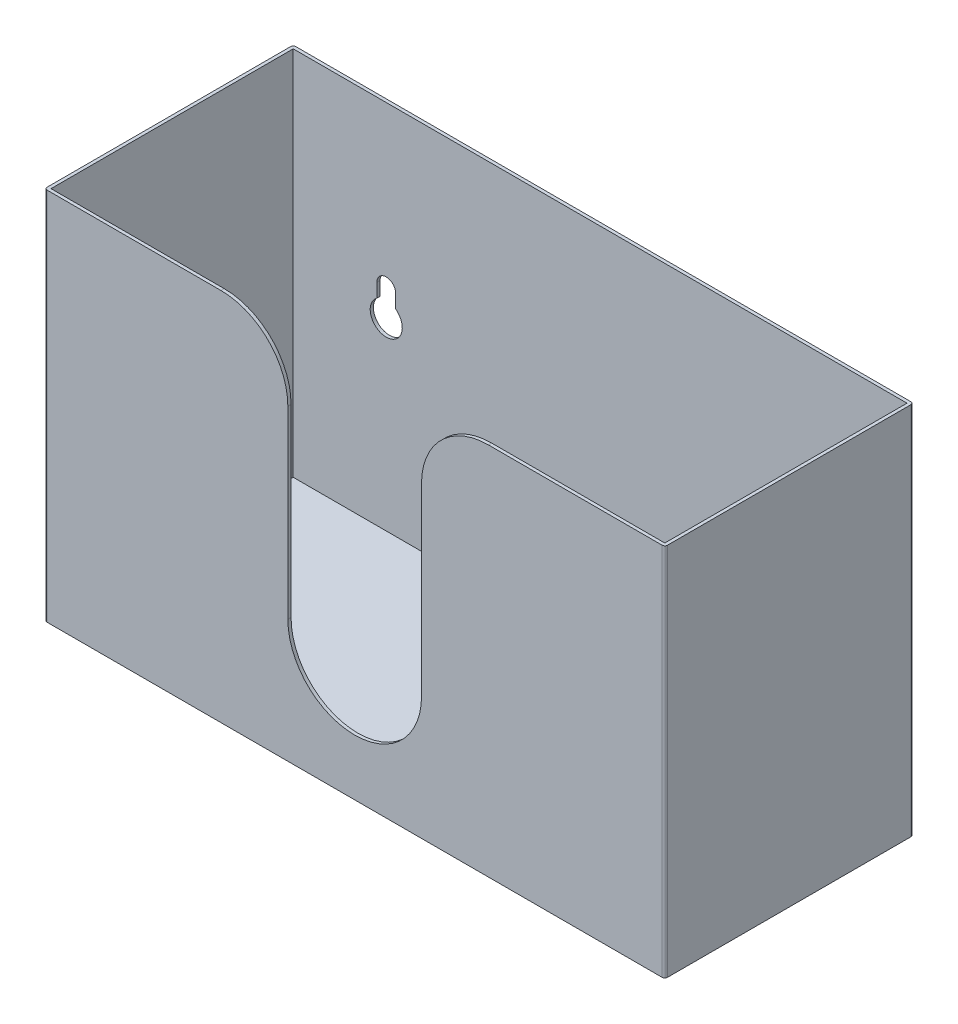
ISO-10303-21;
HEADER;
FILE_DESCRIPTION(('STEP AP214'),'2;1');
FILE_NAME('part.step','',(''),(''),'','','');
FILE_SCHEMA(('AUTOMOTIVE_DESIGN { 1 0 10303 214 1 1 1 1 }'));
ENDSEC;
DATA;
#1=APPLICATION_CONTEXT('core data for automotive mechanical design processes');
#2=APPLICATION_PROTOCOL_DEFINITION('international standard','automotive_design',2000,#1);
#3=PRODUCT_CONTEXT('',#1,'mechanical');
#4=PRODUCT('Part','Part','',(#3));
#5=PRODUCT_RELATED_PRODUCT_CATEGORY('part','',(#4));
#6=PRODUCT_DEFINITION_FORMATION('','',#4);
#7=PRODUCT_DEFINITION_CONTEXT('part definition',#1,'design');
#8=PRODUCT_DEFINITION('design','',#6,#7);
#9=PRODUCT_DEFINITION_SHAPE('','',#8);
#10=(LENGTH_UNIT() NAMED_UNIT(*) SI_UNIT(.MILLI.,.METRE.));
#11=(NAMED_UNIT(*) PLANE_ANGLE_UNIT() SI_UNIT($,.RADIAN.));
#12=(NAMED_UNIT(*) SI_UNIT($,.STERADIAN.) SOLID_ANGLE_UNIT());
#13=UNCERTAINTY_MEASURE_WITH_UNIT(LENGTH_MEASURE(1.E-05),#10,'distance_accuracy_value','');
#14=(GEOMETRIC_REPRESENTATION_CONTEXT(3) GLOBAL_UNCERTAINTY_ASSIGNED_CONTEXT((#13)) GLOBAL_UNIT_ASSIGNED_CONTEXT((#10,
#11,#12)) REPRESENTATION_CONTEXT('',''));
#15=CARTESIAN_POINT('',(0.,0.,0.));
#16=DIRECTION('',(0.,0.,1.));
#17=DIRECTION('',(1.,0.,0.));
#18=AXIS2_PLACEMENT_3D('',#15,#16,#17);
#19=CARTESIAN_POINT('',(116.,140.,-46.5));
#20=DIRECTION('',(0.,0.,1.));
#21=DIRECTION('',(1.,0.,0.));
#22=AXIS2_PLACEMENT_3D('',#19,#20,#21);
#23=PLANE('',#22);
#24=DIRECTION('',(0.,1.,0.));
#25=VECTOR('',#24,1.);
#26=CARTESIAN_POINT('',(76.5000000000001,1.06165076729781E-13,-46.5));
#27=LINE('',#26,#25);
#28=CARTESIAN_POINT('',(76.5,74.8733971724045,-46.5));
#29=VERTEX_POINT('',#28);
#30=CARTESIAN_POINT('',(76.5,80.,-46.5));
#31=VERTEX_POINT('',#30);
#32=EDGE_CURVE('E222',#29,#31,#27,.T.);
#33=ORIENTED_EDGE('',*,*,#32,.F.);
#34=CARTESIAN_POINT('',(80.,70.,-46.5));
#35=DIRECTION('',(0.,0.,-1.));
#36=DIRECTION('',(-1.,0.,0.));
#37=AXIS2_PLACEMENT_3D('',#34,#35,#36);
#38=CIRCLE('',#37,6.00000000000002);
#39=CARTESIAN_POINT('',(83.5,74.8733971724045,-46.5));
#40=VERTEX_POINT('',#39);
#41=EDGE_CURVE('E48',#40,#29,#38,.T.);
#42=ORIENTED_EDGE('',*,*,#41,.F.);
#43=DIRECTION('',(0.,1.,0.));
#44=VECTOR('',#43,1.);
#45=CARTESIAN_POINT('',(83.4999999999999,-1.15879528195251E-13,-46.5));
#46=LINE('',#45,#44);
#47=CARTESIAN_POINT('',(83.5,80.,-46.5));
#48=VERTEX_POINT('',#47);
#49=EDGE_CURVE('E228',#40,#48,#46,.T.);
#50=ORIENTED_EDGE('',*,*,#49,.T.);
#51=CARTESIAN_POINT('',(80.,80.,-46.5));
#52=DIRECTION('',(0.,0.,-1.));
#53=DIRECTION('',(-1.,0.,0.));
#54=AXIS2_PLACEMENT_3D('',#51,#52,#53);
#55=CIRCLE('',#54,3.50000000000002);
#56=EDGE_CURVE('E212',#31,#48,#55,.T.);
#57=ORIENTED_EDGE('',*,*,#56,.F.);
#58=EDGE_LOOP('',(#33,#42,#50,#57));
#59=FACE_BOUND('',#58,.T.);
#60=DIRECTION('',(-1.,0.,0.));
#61=VECTOR('',#60,1.);
#62=CARTESIAN_POINT('',(116.,0.,-46.5));
#63=LINE('',#62,#61);
#64=CARTESIAN_POINT('',(115.,0.,-46.5));
#65=VERTEX_POINT('',#64);
#66=CARTESIAN_POINT('',(-115.,0.,-46.5));
#67=VERTEX_POINT('',#66);
#68=EDGE_CURVE('E303',#65,#67,#63,.T.);
#69=ORIENTED_EDGE('',*,*,#68,.T.);
#70=DIRECTION('',(0.,-1.,0.));
#71=VECTOR('',#70,1.);
#72=CARTESIAN_POINT('',(-115.,140.,-46.5));
#73=LINE('',#72,#71);
#74=CARTESIAN_POINT('',(-115.,140.,-46.5));
#75=VERTEX_POINT('',#74);
#76=EDGE_CURVE('E339',#67,#75,#73,.F.);
#77=ORIENTED_EDGE('',*,*,#76,.T.);
#78=DIRECTION('',(-1.,0.,0.));
#79=VECTOR('',#78,1.);
#80=CARTESIAN_POINT('',(116.,140.,-46.5));
#81=LINE('',#80,#79);
#82=CARTESIAN_POINT('',(115.,140.,-46.5));
#83=VERTEX_POINT('',#82);
#84=EDGE_CURVE('E310',#83,#75,#81,.T.);
#85=ORIENTED_EDGE('',*,*,#84,.F.);
#86=DIRECTION('',(0.,-1.,0.));
#87=VECTOR('',#86,1.);
#88=CARTESIAN_POINT('',(115.,140.,-46.5));
#89=LINE('',#88,#87);
#90=EDGE_CURVE('E336',#83,#65,#89,.T.);
#91=ORIENTED_EDGE('',*,*,#90,.T.);
#92=EDGE_LOOP('',(#69,#77,#85,#91));
#93=FACE_BOUND('',#92,.T.);
#94=CARTESIAN_POINT('',(-80.,70.,-46.5));
#95=DIRECTION('',(0.,0.,-1.));
#96=DIRECTION('',(-1.,0.,0.));
#97=AXIS2_PLACEMENT_3D('',#94,#95,#96);
#98=CIRCLE('',#97,6.00000000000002);
#99=CARTESIAN_POINT('',(-83.5,74.8733971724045,-46.5));
#100=VERTEX_POINT('',#99);
#101=CARTESIAN_POINT('',(-76.5,74.8733971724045,-46.5));
#102=VERTEX_POINT('',#101);
#103=EDGE_CURVE('E56',#100,#102,#98,.F.);
#104=ORIENTED_EDGE('',*,*,#103,.T.);
#105=DIRECTION('',(0.,1.,0.));
#106=VECTOR('',#105,1.);
#107=CARTESIAN_POINT('',(-76.5000000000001,1.06165076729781E-13,-46.5));
#108=LINE('',#107,#106);
#109=CARTESIAN_POINT('',(-76.5,80.,-46.5));
#110=VERTEX_POINT('',#109);
#111=EDGE_CURVE('E245',#102,#110,#108,.T.);
#112=ORIENTED_EDGE('',*,*,#111,.T.);
#113=CARTESIAN_POINT('',(-80.,80.,-46.5));
#114=DIRECTION('',(0.,0.,-1.));
#115=DIRECTION('',(-1.,0.,0.));
#116=AXIS2_PLACEMENT_3D('',#113,#114,#115);
#117=CIRCLE('',#116,3.50000000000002);
#118=CARTESIAN_POINT('',(-83.5,80.,-46.5));
#119=VERTEX_POINT('',#118);
#120=EDGE_CURVE('E242',#110,#119,#117,.F.);
#121=ORIENTED_EDGE('',*,*,#120,.T.);
#122=DIRECTION('',(0.,1.,0.));
#123=VECTOR('',#122,1.);
#124=CARTESIAN_POINT('',(-83.4999999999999,-1.15879528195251E-13,-46.5));
#125=LINE('',#124,#123);
#126=EDGE_CURVE('E239',#100,#119,#125,.T.);
#127=ORIENTED_EDGE('',*,*,#126,.F.);
#128=EDGE_LOOP('',(#104,#112,#121,#127));
#129=FACE_BOUND('',#128,.T.);
#130=ADVANCED_FACE('F33',(#59,#93,#129),#23,.F.);
#131=CARTESIAN_POINT('',(116.,140.,-45.3));
#132=DIRECTION('',(0.,0.,1.));
#133=DIRECTION('',(1.,0.,0.));
#134=AXIS2_PLACEMENT_3D('',#131,#132,#133);
#135=PLANE('',#134);
#136=CARTESIAN_POINT('',(80.,70.,-45.3));
#137=DIRECTION('',(0.,0.,1.));
#138=DIRECTION('',(1.,0.,0.));
#139=AXIS2_PLACEMENT_3D('',#136,#137,#138);
#140=CIRCLE('',#139,6.00000000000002);
#141=CARTESIAN_POINT('',(76.5,74.8733971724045,-45.3));
#142=VERTEX_POINT('',#141);
#143=CARTESIAN_POINT('',(83.5,74.8733971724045,-45.3));
#144=VERTEX_POINT('',#143);
#145=EDGE_CURVE('E11',#142,#144,#140,.T.);
#146=ORIENTED_EDGE('',*,*,#145,.F.);
#147=DIRECTION('',(0.,-1.,0.));
#148=VECTOR('',#147,1.);
#149=CARTESIAN_POINT('',(76.4999999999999,140.,-45.3));
#150=LINE('',#149,#148);
#151=CARTESIAN_POINT('',(76.5,80.,-45.3));
#152=VERTEX_POINT('',#151);
#153=EDGE_CURVE('E397',#152,#142,#150,.T.);
#154=ORIENTED_EDGE('',*,*,#153,.F.);
#155=CARTESIAN_POINT('',(80.,80.,-45.3));
#156=DIRECTION('',(0.,0.,1.));
#157=DIRECTION('',(1.,0.,0.));
#158=AXIS2_PLACEMENT_3D('',#155,#156,#157);
#159=CIRCLE('',#158,3.50000000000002);
#160=CARTESIAN_POINT('',(83.5,80.,-45.3));
#161=VERTEX_POINT('',#160);
#162=EDGE_CURVE('E215',#161,#152,#159,.T.);
#163=ORIENTED_EDGE('',*,*,#162,.F.);
#164=DIRECTION('',(0.,-1.,0.));
#165=VECTOR('',#164,1.);
#166=CARTESIAN_POINT('',(83.5000000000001,140.,-45.3));
#167=LINE('',#166,#165);
#168=EDGE_CURVE('E41',#161,#144,#167,.T.);
#169=ORIENTED_EDGE('',*,*,#168,.T.);
#170=EDGE_LOOP('',(#146,#154,#163,#169));
#171=FACE_BOUND('',#170,.T.);
#172=DIRECTION('',(-1.,0.,0.));
#173=VECTOR('',#172,1.);
#174=CARTESIAN_POINT('',(116.,1.20000000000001,-45.3));
#175=LINE('',#174,#173);
#176=CARTESIAN_POINT('',(114.8,1.2,-45.3));
#177=VERTEX_POINT('',#176);
#178=CARTESIAN_POINT('',(-114.8,1.2,-45.3));
#179=VERTEX_POINT('',#178);
#180=EDGE_CURVE('E284',#177,#179,#175,.T.);
#181=ORIENTED_EDGE('',*,*,#180,.F.);
#182=DIRECTION('',(0.,1.,0.));
#183=VECTOR('',#182,1.);
#184=CARTESIAN_POINT('',(114.8,140.,-45.3));
#185=LINE('',#184,#183);
#186=CARTESIAN_POINT('',(114.8,140.,-45.3));
#187=VERTEX_POINT('',#186);
#188=EDGE_CURVE('E271',#177,#187,#185,.T.);
#189=ORIENTED_EDGE('',*,*,#188,.T.);
#190=DIRECTION('',(-1.,0.,0.));
#191=VECTOR('',#190,1.);
#192=CARTESIAN_POINT('',(116.,140.,-45.3));
#193=LINE('',#192,#191);
#194=CARTESIAN_POINT('',(-114.8,140.,-45.3));
#195=VERTEX_POINT('',#194);
#196=EDGE_CURVE('E276',#187,#195,#193,.T.);
#197=ORIENTED_EDGE('',*,*,#196,.T.);
#198=DIRECTION('',(0.,1.,0.));
#199=VECTOR('',#198,1.);
#200=CARTESIAN_POINT('',(-114.8,140.,-45.3));
#201=LINE('',#200,#199);
#202=EDGE_CURVE('E269',#179,#195,#201,.T.);
#203=ORIENTED_EDGE('',*,*,#202,.F.);
#204=EDGE_LOOP('',(#181,#189,#197,#203));
#205=FACE_BOUND('',#204,.T.);
#206=DIRECTION('',(0.,-1.,0.));
#207=VECTOR('',#206,1.);
#208=CARTESIAN_POINT('',(-76.4999999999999,140.,-45.3));
#209=LINE('',#208,#207);
#210=CARTESIAN_POINT('',(-76.5,80.,-45.3));
#211=VERTEX_POINT('',#210);
#212=CARTESIAN_POINT('',(-76.5,74.8733971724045,-45.3));
#213=VERTEX_POINT('',#212);
#214=EDGE_CURVE('E391',#211,#213,#209,.T.);
#215=ORIENTED_EDGE('',*,*,#214,.T.);
#216=CARTESIAN_POINT('',(-80.,70.,-45.3));
#217=DIRECTION('',(0.,0.,1.));
#218=DIRECTION('',(1.,0.,0.));
#219=AXIS2_PLACEMENT_3D('',#216,#217,#218);
#220=CIRCLE('',#219,6.00000000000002);
#221=CARTESIAN_POINT('',(-83.5,74.8733971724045,-45.3));
#222=VERTEX_POINT('',#221);
#223=EDGE_CURVE('E394',#213,#222,#220,.F.);
#224=ORIENTED_EDGE('',*,*,#223,.T.);
#225=DIRECTION('',(0.,-1.,0.));
#226=VECTOR('',#225,1.);
#227=CARTESIAN_POINT('',(-83.5000000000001,140.,-45.3));
#228=LINE('',#227,#226);
#229=CARTESIAN_POINT('',(-83.5,80.,-45.3));
#230=VERTEX_POINT('',#229);
#231=EDGE_CURVE('E386',#230,#222,#228,.T.);
#232=ORIENTED_EDGE('',*,*,#231,.F.);
#233=CARTESIAN_POINT('',(-80.,80.,-45.3));
#234=DIRECTION('',(0.,0.,1.));
#235=DIRECTION('',(1.,0.,0.));
#236=AXIS2_PLACEMENT_3D('',#233,#234,#235);
#237=CIRCLE('',#236,3.50000000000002);
#238=EDGE_CURVE('E388',#230,#211,#237,.F.);
#239=ORIENTED_EDGE('',*,*,#238,.T.);
#240=EDGE_LOOP('',(#215,#224,#232,#239));
#241=FACE_BOUND('',#240,.T.);
#242=ADVANCED_FACE('F402',(#171,#205,#241),#135,.T.);
#243=CARTESIAN_POINT('',(-116.,140.,46.5));
#244=DIRECTION('',(1.,0.,0.));
#245=DIRECTION('',(0.,0.,-1.));
#246=AXIS2_PLACEMENT_3D('',#243,#244,#245);
#247=PLANE('',#246);
#248=DIRECTION('',(0.,0.,1.));
#249=VECTOR('',#248,1.);
#250=CARTESIAN_POINT('',(-116.,140.,46.5));
#251=LINE('',#250,#249);
#252=CARTESIAN_POINT('',(-116.,140.,-45.5));
#253=VERTEX_POINT('',#252);
#254=CARTESIAN_POINT('',(-116.,140.,45.5));
#255=VERTEX_POINT('',#254);
#256=EDGE_CURVE('E299',#253,#255,#251,.T.);
#257=ORIENTED_EDGE('',*,*,#256,.F.);
#258=DIRECTION('',(0.,-1.,0.));
#259=VECTOR('',#258,1.);
#260=CARTESIAN_POINT('',(-116.,140.,-45.5));
#261=LINE('',#260,#259);
#262=CARTESIAN_POINT('',(-116.,0.,-45.5));
#263=VERTEX_POINT('',#262);
#264=EDGE_CURVE('E325',#253,#263,#261,.T.);
#265=ORIENTED_EDGE('',*,*,#264,.T.);
#266=DIRECTION('',(0.,0.,1.));
#267=VECTOR('',#266,1.);
#268=CARTESIAN_POINT('',(-116.,0.,46.5));
#269=LINE('',#268,#267);
#270=CARTESIAN_POINT('',(-116.,0.,45.5));
#271=VERTEX_POINT('',#270);
#272=EDGE_CURVE('E282',#263,#271,#269,.T.);
#273=ORIENTED_EDGE('',*,*,#272,.T.);
#274=DIRECTION('',(0.,-1.,0.));
#275=VECTOR('',#274,1.);
#276=CARTESIAN_POINT('',(-116.,140.,45.5));
#277=LINE('',#276,#275);
#278=EDGE_CURVE('E313',#271,#255,#277,.F.);
#279=ORIENTED_EDGE('',*,*,#278,.T.);
#280=EDGE_LOOP('',(#257,#265,#273,#279));
#281=FACE_BOUND('',#280,.T.);
#282=ADVANCED_FACE('F426',(#281),#247,.F.);
#283=CARTESIAN_POINT('',(116.,140.,46.5));
#284=DIRECTION('',(0.,0.,-1.));
#285=DIRECTION('',(-1.,0.,0.));
#286=AXIS2_PLACEMENT_3D('',#283,#284,#285);
#287=PLANE('',#286);
#288=DIRECTION('',(1.,0.,0.));
#289=VECTOR('',#288,1.);
#290=CARTESIAN_POINT('',(116.,140.,46.5));
#291=LINE('',#290,#289);
#292=CARTESIAN_POINT('',(50.0000000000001,140.,46.5));
#293=VERTEX_POINT('',#292);
#294=CARTESIAN_POINT('',(115.,140.,46.5));
#295=VERTEX_POINT('',#294);
#296=EDGE_CURVE('E302',#293,#295,#291,.T.);
#297=ORIENTED_EDGE('',*,*,#296,.F.);
#298=CARTESIAN_POINT('',(50.,115.,46.5));
#299=DIRECTION('',(0.,0.,-1.));
#300=DIRECTION('',(-1.,0.,0.));
#301=AXIS2_PLACEMENT_3D('',#298,#299,#300);
#302=CIRCLE('',#301,25.);
#303=CARTESIAN_POINT('',(25.,115.,46.5));
#304=VERTEX_POINT('',#303);
#305=EDGE_CURVE('E381',#293,#304,#302,.F.);
#306=ORIENTED_EDGE('',*,*,#305,.T.);
#307=DIRECTION('',(0.,1.,0.));
#308=VECTOR('',#307,1.);
#309=CARTESIAN_POINT('',(25.,234.,46.5));
#310=LINE('',#309,#308);
#311=CARTESIAN_POINT('',(25.,46.,46.5));
#312=VERTEX_POINT('',#311);
#313=EDGE_CURVE('E260',#312,#304,#310,.T.);
#314=ORIENTED_EDGE('',*,*,#313,.F.);
#315=CARTESIAN_POINT('',(0.,46.,46.5));
#316=DIRECTION('',(0.,0.,1.));
#317=DIRECTION('',(1.,0.,0.));
#318=AXIS2_PLACEMENT_3D('',#315,#316,#317);
#319=CIRCLE('',#318,25.);
#320=CARTESIAN_POINT('',(-25.,46.,46.5));
#321=VERTEX_POINT('',#320);
#322=EDGE_CURVE('E257',#321,#312,#319,.T.);
#323=ORIENTED_EDGE('',*,*,#322,.F.);
#324=DIRECTION('',(0.,-1.,0.));
#325=VECTOR('',#324,1.);
#326=CARTESIAN_POINT('',(-25.,234.,46.5));
#327=LINE('',#326,#325);
#328=CARTESIAN_POINT('',(-25.,115.,46.5));
#329=VERTEX_POINT('',#328);
#330=EDGE_CURVE('E235',#329,#321,#327,.T.);
#331=ORIENTED_EDGE('',*,*,#330,.F.);
#332=CARTESIAN_POINT('',(-50.,115.,46.5));
#333=DIRECTION('',(0.,0.,-1.));
#334=DIRECTION('',(-1.,0.,0.));
#335=AXIS2_PLACEMENT_3D('',#332,#333,#334);
#336=CIRCLE('',#335,25.);
#337=CARTESIAN_POINT('',(-49.9999999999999,140.,46.5));
#338=VERTEX_POINT('',#337);
#339=EDGE_CURVE('E379',#329,#338,#336,.F.);
#340=ORIENTED_EDGE('',*,*,#339,.T.);
#341=CARTESIAN_POINT('',(-115.,140.,46.5));
#342=VERTEX_POINT('',#341);
#343=EDGE_CURVE('E304',#342,#338,#291,.T.);
#344=ORIENTED_EDGE('',*,*,#343,.F.);
#345=DIRECTION('',(0.,-1.,0.));
#346=VECTOR('',#345,1.);
#347=CARTESIAN_POINT('',(-115.,140.,46.5));
#348=LINE('',#347,#346);
#349=CARTESIAN_POINT('',(-115.,0.,46.5));
#350=VERTEX_POINT('',#349);
#351=EDGE_CURVE('E354',#342,#350,#348,.T.);
#352=ORIENTED_EDGE('',*,*,#351,.T.);
#353=DIRECTION('',(1.,0.,0.));
#354=VECTOR('',#353,1.);
#355=CARTESIAN_POINT('',(116.,0.,46.5));
#356=LINE('',#355,#354);
#357=CARTESIAN_POINT('',(115.,0.,46.5));
#358=VERTEX_POINT('',#357);
#359=EDGE_CURVE('E316',#350,#358,#356,.T.);
#360=ORIENTED_EDGE('',*,*,#359,.T.);
#361=DIRECTION('',(0.,-1.,0.));
#362=VECTOR('',#361,1.);
#363=CARTESIAN_POINT('',(115.,140.,46.5));
#364=LINE('',#363,#362);
#365=EDGE_CURVE('E357',#358,#295,#364,.F.);
#366=ORIENTED_EDGE('',*,*,#365,.T.);
#367=EDGE_LOOP('',(#297,#306,#314,#323,#331,#340,#344,#352,#360,#366));
#368=FACE_BOUND('',#367,.T.);
#369=ADVANCED_FACE('F436',(#368),#287,.F.);
#370=CARTESIAN_POINT('',(116.,140.,46.5));
#371=DIRECTION('',(-1.,0.,0.));
#372=DIRECTION('',(0.,0.,1.));
#373=AXIS2_PLACEMENT_3D('',#370,#371,#372);
#374=PLANE('',#373);
#375=DIRECTION('',(0.,0.,-1.));
#376=VECTOR('',#375,1.);
#377=CARTESIAN_POINT('',(116.,0.,46.5));
#378=LINE('',#377,#376);
#379=CARTESIAN_POINT('',(116.,0.,45.5));
#380=VERTEX_POINT('',#379);
#381=CARTESIAN_POINT('',(116.,0.,-45.5));
#382=VERTEX_POINT('',#381);
#383=EDGE_CURVE('E319',#380,#382,#378,.T.);
#384=ORIENTED_EDGE('',*,*,#383,.T.);
#385=DIRECTION('',(0.,-1.,0.));
#386=VECTOR('',#385,1.);
#387=CARTESIAN_POINT('',(116.,140.,-45.5));
#388=LINE('',#387,#386);
#389=CARTESIAN_POINT('',(116.,140.,-45.5));
#390=VERTEX_POINT('',#389);
#391=EDGE_CURVE('E352',#382,#390,#388,.F.);
#392=ORIENTED_EDGE('',*,*,#391,.T.);
#393=DIRECTION('',(0.,0.,-1.));
#394=VECTOR('',#393,1.);
#395=CARTESIAN_POINT('',(116.,140.,46.5));
#396=LINE('',#395,#394);
#397=CARTESIAN_POINT('',(116.,140.,45.5));
#398=VERTEX_POINT('',#397);
#399=EDGE_CURVE('E307',#398,#390,#396,.T.);
#400=ORIENTED_EDGE('',*,*,#399,.F.);
#401=DIRECTION('',(0.,-1.,0.));
#402=VECTOR('',#401,1.);
#403=CARTESIAN_POINT('',(116.,140.,45.5));
#404=LINE('',#403,#402);
#405=EDGE_CURVE('E349',#398,#380,#404,.T.);
#406=ORIENTED_EDGE('',*,*,#405,.T.);
#407=EDGE_LOOP('',(#384,#392,#400,#406));
#408=FACE_BOUND('',#407,.T.);
#409=ADVANCED_FACE('F432',(#408),#374,.F.);
#410=CARTESIAN_POINT('',(0.,140.,0.));
#411=DIRECTION('',(0.,1.,0.));
#412=DIRECTION('',(0.,0.,1.));
#413=AXIS2_PLACEMENT_3D('',#410,#411,#412);
#414=PLANE('',#413);
#415=DIRECTION('',(1.,0.,0.));
#416=VECTOR('',#415,1.);
#417=CARTESIAN_POINT('',(116.,140.,45.3));
#418=LINE('',#417,#416);
#419=CARTESIAN_POINT('',(50.,140.,45.3));
#420=VERTEX_POINT('',#419);
#421=CARTESIAN_POINT('',(114.8,140.,45.3));
#422=VERTEX_POINT('',#421);
#423=EDGE_CURVE('E290',#420,#422,#418,.T.);
#424=ORIENTED_EDGE('',*,*,#423,.F.);
#425=DIRECTION('',(0.,0.,-1.));
#426=VECTOR('',#425,1.);
#427=CARTESIAN_POINT('',(50.,140.,46.5));
#428=LINE('',#427,#426);
#429=EDGE_CURVE('E377',#420,#293,#428,.F.);
#430=ORIENTED_EDGE('',*,*,#429,.T.);
#431=ORIENTED_EDGE('',*,*,#296,.T.);
#432=CARTESIAN_POINT('',(115.,140.,45.5));
#433=DIRECTION('',(0.,1.,0.));
#434=DIRECTION('',(0.,0.,1.));
#435=AXIS2_PLACEMENT_3D('',#432,#433,#434);
#436=CIRCLE('',#435,1.);
#437=EDGE_CURVE('E343',#295,#398,#436,.T.);
#438=ORIENTED_EDGE('',*,*,#437,.T.);
#439=ORIENTED_EDGE('',*,*,#399,.T.);
#440=CARTESIAN_POINT('',(115.,140.,-45.5));
#441=DIRECTION('',(0.,1.,0.));
#442=DIRECTION('',(0.,0.,1.));
#443=AXIS2_PLACEMENT_3D('',#440,#441,#442);
#444=CIRCLE('',#443,1.);
#445=EDGE_CURVE('E345',#390,#83,#444,.T.);
#446=ORIENTED_EDGE('',*,*,#445,.T.);
#447=ORIENTED_EDGE('',*,*,#84,.T.);
#448=CARTESIAN_POINT('',(-115.,140.,-45.5));
#449=DIRECTION('',(0.,1.,0.));
#450=DIRECTION('',(0.,0.,1.));
#451=AXIS2_PLACEMENT_3D('',#448,#449,#450);
#452=CIRCLE('',#451,1.);
#453=EDGE_CURVE('E347',#75,#253,#452,.T.);
#454=ORIENTED_EDGE('',*,*,#453,.T.);
#455=ORIENTED_EDGE('',*,*,#256,.T.);
#456=CARTESIAN_POINT('',(-115.,140.,45.5));
#457=DIRECTION('',(0.,1.,0.));
#458=DIRECTION('',(0.,0.,1.));
#459=AXIS2_PLACEMENT_3D('',#456,#457,#458);
#460=CIRCLE('',#459,1.);
#461=EDGE_CURVE('E341',#255,#342,#460,.T.);
#462=ORIENTED_EDGE('',*,*,#461,.T.);
#463=ORIENTED_EDGE('',*,*,#343,.T.);
#464=DIRECTION('',(0.,0.,1.));
#465=VECTOR('',#464,1.);
#466=CARTESIAN_POINT('',(-50.,140.,45.3));
#467=LINE('',#466,#465);
#468=CARTESIAN_POINT('',(-50.,140.,45.3));
#469=VERTEX_POINT('',#468);
#470=EDGE_CURVE('E375',#338,#469,#467,.F.);
#471=ORIENTED_EDGE('',*,*,#470,.T.);
#472=CARTESIAN_POINT('',(-114.8,140.,45.3));
#473=VERTEX_POINT('',#472);
#474=EDGE_CURVE('E291',#473,#469,#418,.T.);
#475=ORIENTED_EDGE('',*,*,#474,.F.);
#476=DIRECTION('',(0.,0.,1.));
#477=VECTOR('',#476,1.);
#478=CARTESIAN_POINT('',(-114.8,140.,46.5));
#479=LINE('',#478,#477);
#480=EDGE_CURVE('E287',#195,#473,#479,.T.);
#481=ORIENTED_EDGE('',*,*,#480,.F.);
#482=ORIENTED_EDGE('',*,*,#196,.F.);
#483=DIRECTION('',(0.,0.,-1.));
#484=VECTOR('',#483,1.);
#485=CARTESIAN_POINT('',(114.8,140.,46.5));
#486=LINE('',#485,#484);
#487=EDGE_CURVE('E294',#422,#187,#486,.T.);
#488=ORIENTED_EDGE('',*,*,#487,.F.);
#489=EDGE_LOOP('',(#424,#430,#431,#438,#439,#446,#447,#454,#455,#462,#463,#471,#475,#481,#482,#488));
#490=FACE_BOUND('',#489,.T.);
#491=ADVANCED_FACE('F435',(#490),#414,.T.);
#492=CARTESIAN_POINT('',(0.,0.,0.));
#493=DIRECTION('',(0.,1.,0.));
#494=DIRECTION('',(0.,0.,1.));
#495=AXIS2_PLACEMENT_3D('',#492,#493,#494);
#496=PLANE('',#495);
#497=ORIENTED_EDGE('',*,*,#272,.F.);
#498=CARTESIAN_POINT('',(-115.,0.,-45.5));
#499=DIRECTION('',(0.,1.,0.));
#500=DIRECTION('',(0.,0.,1.));
#501=AXIS2_PLACEMENT_3D('',#498,#499,#500);
#502=CIRCLE('',#501,1.);
#503=EDGE_CURVE('E334',#263,#67,#502,.F.);
#504=ORIENTED_EDGE('',*,*,#503,.T.);
#505=ORIENTED_EDGE('',*,*,#68,.F.);
#506=CARTESIAN_POINT('',(115.,0.,-45.5));
#507=DIRECTION('',(0.,1.,0.));
#508=DIRECTION('',(0.,0.,1.));
#509=AXIS2_PLACEMENT_3D('',#506,#507,#508);
#510=CIRCLE('',#509,1.);
#511=EDGE_CURVE('E332',#65,#382,#510,.F.);
#512=ORIENTED_EDGE('',*,*,#511,.T.);
#513=ORIENTED_EDGE('',*,*,#383,.F.);
#514=CARTESIAN_POINT('',(115.,0.,45.5));
#515=DIRECTION('',(0.,1.,0.));
#516=DIRECTION('',(0.,0.,1.));
#517=AXIS2_PLACEMENT_3D('',#514,#515,#516);
#518=CIRCLE('',#517,1.);
#519=EDGE_CURVE('E330',#380,#358,#518,.F.);
#520=ORIENTED_EDGE('',*,*,#519,.T.);
#521=ORIENTED_EDGE('',*,*,#359,.F.);
#522=CARTESIAN_POINT('',(-115.,0.,45.5));
#523=DIRECTION('',(0.,1.,0.));
#524=DIRECTION('',(0.,0.,1.));
#525=AXIS2_PLACEMENT_3D('',#522,#523,#524);
#526=CIRCLE('',#525,1.);
#527=EDGE_CURVE('E328',#350,#271,#526,.F.);
#528=ORIENTED_EDGE('',*,*,#527,.T.);
#529=EDGE_LOOP('',(#497,#504,#505,#512,#513,#520,#521,#528));
#530=FACE_BOUND('',#529,.T.);
#531=ADVANCED_FACE('F430',(#530),#496,.F.);
#532=CARTESIAN_POINT('',(-115.,140.,-45.5));
#533=DIRECTION('',(0.,-1.,0.));
#534=DIRECTION('',(0.,0.,-1.));
#535=AXIS2_PLACEMENT_3D('',#532,#533,#534);
#536=CYLINDRICAL_SURFACE('',#535,1.);
#537=ORIENTED_EDGE('',*,*,#453,.F.);
#538=ORIENTED_EDGE('',*,*,#76,.F.);
#539=ORIENTED_EDGE('',*,*,#503,.F.);
#540=ORIENTED_EDGE('',*,*,#264,.F.);
#541=EDGE_LOOP('',(#537,#538,#539,#540));
#542=FACE_BOUND('',#541,.T.);
#543=ADVANCED_FACE('F444',(#542),#536,.T.);
#544=CARTESIAN_POINT('',(115.,140.,-45.5));
#545=DIRECTION('',(0.,-1.,0.));
#546=DIRECTION('',(0.,0.,-1.));
#547=AXIS2_PLACEMENT_3D('',#544,#545,#546);
#548=CYLINDRICAL_SURFACE('',#547,1.);
#549=ORIENTED_EDGE('',*,*,#445,.F.);
#550=ORIENTED_EDGE('',*,*,#391,.F.);
#551=ORIENTED_EDGE('',*,*,#511,.F.);
#552=ORIENTED_EDGE('',*,*,#90,.F.);
#553=EDGE_LOOP('',(#549,#550,#551,#552));
#554=FACE_BOUND('',#553,.T.);
#555=ADVANCED_FACE('F447',(#554),#548,.T.);
#556=CARTESIAN_POINT('',(115.,140.,45.5));
#557=DIRECTION('',(0.,-1.,0.));
#558=DIRECTION('',(0.,0.,-1.));
#559=AXIS2_PLACEMENT_3D('',#556,#557,#558);
#560=CYLINDRICAL_SURFACE('',#559,1.);
#561=ORIENTED_EDGE('',*,*,#437,.F.);
#562=ORIENTED_EDGE('',*,*,#365,.F.);
#563=ORIENTED_EDGE('',*,*,#519,.F.);
#564=ORIENTED_EDGE('',*,*,#405,.F.);
#565=EDGE_LOOP('',(#561,#562,#563,#564));
#566=FACE_BOUND('',#565,.T.);
#567=ADVANCED_FACE('F451',(#566),#560,.T.);
#568=CARTESIAN_POINT('',(-115.,140.,45.5));
#569=DIRECTION('',(0.,-1.,0.));
#570=DIRECTION('',(0.,0.,-1.));
#571=AXIS2_PLACEMENT_3D('',#568,#569,#570);
#572=CYLINDRICAL_SURFACE('',#571,1.);
#573=ORIENTED_EDGE('',*,*,#461,.F.);
#574=ORIENTED_EDGE('',*,*,#278,.F.);
#575=ORIENTED_EDGE('',*,*,#527,.F.);
#576=ORIENTED_EDGE('',*,*,#351,.F.);
#577=EDGE_LOOP('',(#573,#574,#575,#576));
#578=FACE_BOUND('',#577,.T.);
#579=ADVANCED_FACE('F455',(#578),#572,.T.);
#580=CARTESIAN_POINT('',(-114.8,140.,46.5));
#581=DIRECTION('',(1.,0.,0.));
#582=DIRECTION('',(0.,0.,-1.));
#583=AXIS2_PLACEMENT_3D('',#580,#581,#582);
#584=PLANE('',#583);
#585=ORIENTED_EDGE('',*,*,#480,.T.);
#586=DIRECTION('',(0.,1.,0.));
#587=VECTOR('',#586,1.);
#588=CARTESIAN_POINT('',(-114.8,140.,45.3));
#589=LINE('',#588,#587);
#590=CARTESIAN_POINT('',(-114.8,1.2,45.3));
#591=VERTEX_POINT('',#590);
#592=EDGE_CURVE('E272',#591,#473,#589,.T.);
#593=ORIENTED_EDGE('',*,*,#592,.F.);
#594=DIRECTION('',(0.,0.,1.));
#595=VECTOR('',#594,1.);
#596=CARTESIAN_POINT('',(-114.8,1.20000000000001,46.5));
#597=LINE('',#596,#595);
#598=EDGE_CURVE('E266',#179,#591,#597,.T.);
#599=ORIENTED_EDGE('',*,*,#598,.F.);
#600=ORIENTED_EDGE('',*,*,#202,.T.);
#601=EDGE_LOOP('',(#585,#593,#599,#600));
#602=FACE_BOUND('',#601,.T.);
#603=ADVANCED_FACE('F458',(#602),#584,.T.);
#604=CARTESIAN_POINT('',(116.,140.,45.3));
#605=DIRECTION('',(0.,0.,-1.));
#606=DIRECTION('',(-1.,0.,0.));
#607=AXIS2_PLACEMENT_3D('',#604,#605,#606);
#608=PLANE('',#607);
#609=DIRECTION('',(0.,-1.,0.));
#610=VECTOR('',#609,1.);
#611=CARTESIAN_POINT('',(25.,140.,45.3));
#612=LINE('',#611,#610);
#613=CARTESIAN_POINT('',(25.,115.,45.3));
#614=VERTEX_POINT('',#613);
#615=CARTESIAN_POINT('',(25.,46.,45.3));
#616=VERTEX_POINT('',#615);
#617=EDGE_CURVE('E366',#614,#616,#612,.T.);
#618=ORIENTED_EDGE('',*,*,#617,.F.);
#619=CARTESIAN_POINT('',(50.,115.,45.3));
#620=DIRECTION('',(0.,0.,-1.));
#621=DIRECTION('',(-1.,0.,0.));
#622=AXIS2_PLACEMENT_3D('',#619,#620,#621);
#623=CIRCLE('',#622,25.);
#624=EDGE_CURVE('E373',#614,#420,#623,.T.);
#625=ORIENTED_EDGE('',*,*,#624,.T.);
#626=ORIENTED_EDGE('',*,*,#423,.T.);
#627=DIRECTION('',(0.,1.,0.));
#628=VECTOR('',#627,1.);
#629=CARTESIAN_POINT('',(114.8,140.,45.3));
#630=LINE('',#629,#628);
#631=CARTESIAN_POINT('',(114.8,1.2,45.3));
#632=VERTEX_POINT('',#631);
#633=EDGE_CURVE('E279',#632,#422,#630,.T.);
#634=ORIENTED_EDGE('',*,*,#633,.F.);
#635=DIRECTION('',(1.,0.,0.));
#636=VECTOR('',#635,1.);
#637=CARTESIAN_POINT('',(116.,1.20000000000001,45.3));
#638=LINE('',#637,#636);
#639=EDGE_CURVE('E274',#591,#632,#638,.T.);
#640=ORIENTED_EDGE('',*,*,#639,.F.);
#641=ORIENTED_EDGE('',*,*,#592,.T.);
#642=ORIENTED_EDGE('',*,*,#474,.T.);
#643=CARTESIAN_POINT('',(-50.,115.,45.3));
#644=DIRECTION('',(0.,0.,-1.));
#645=DIRECTION('',(-1.,0.,0.));
#646=AXIS2_PLACEMENT_3D('',#643,#644,#645);
#647=CIRCLE('',#646,25.);
#648=CARTESIAN_POINT('',(-25.,115.,45.3));
#649=VERTEX_POINT('',#648);
#650=EDGE_CURVE('E371',#469,#649,#647,.T.);
#651=ORIENTED_EDGE('',*,*,#650,.T.);
#652=DIRECTION('',(0.,1.,0.));
#653=VECTOR('',#652,1.);
#654=CARTESIAN_POINT('',(-25.,140.,45.3));
#655=LINE('',#654,#653);
#656=CARTESIAN_POINT('',(-25.,46.,45.3));
#657=VERTEX_POINT('',#656);
#658=EDGE_CURVE('E360',#657,#649,#655,.T.);
#659=ORIENTED_EDGE('',*,*,#658,.F.);
#660=CARTESIAN_POINT('',(0.,46.,45.3));
#661=DIRECTION('',(0.,0.,-1.));
#662=DIRECTION('',(-1.,0.,0.));
#663=AXIS2_PLACEMENT_3D('',#660,#661,#662);
#664=CIRCLE('',#663,25.);
#665=EDGE_CURVE('E363',#616,#657,#664,.T.);
#666=ORIENTED_EDGE('',*,*,#665,.F.);
#667=EDGE_LOOP('',(#618,#625,#626,#634,#640,#641,#642,#651,#659,#666));
#668=FACE_BOUND('',#667,.T.);
#669=ADVANCED_FACE('F496',(#668),#608,.T.);
#670=CARTESIAN_POINT('',(114.8,140.,46.5));
#671=DIRECTION('',(-1.,0.,0.));
#672=DIRECTION('',(0.,0.,1.));
#673=AXIS2_PLACEMENT_3D('',#670,#671,#672);
#674=PLANE('',#673);
#675=DIRECTION('',(0.,0.,-1.));
#676=VECTOR('',#675,1.);
#677=CARTESIAN_POINT('',(114.8,1.20000000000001,46.5));
#678=LINE('',#677,#676);
#679=EDGE_CURVE('E278',#632,#177,#678,.T.);
#680=ORIENTED_EDGE('',*,*,#679,.F.);
#681=ORIENTED_EDGE('',*,*,#633,.T.);
#682=ORIENTED_EDGE('',*,*,#487,.T.);
#683=ORIENTED_EDGE('',*,*,#188,.F.);
#684=EDGE_LOOP('',(#680,#681,#682,#683));
#685=FACE_BOUND('',#684,.T.);
#686=ADVANCED_FACE('F510',(#685),#674,.T.);
#687=CARTESIAN_POINT('',(0.,1.2,0.));
#688=DIRECTION('',(0.,1.,0.));
#689=DIRECTION('',(0.,0.,1.));
#690=AXIS2_PLACEMENT_3D('',#687,#688,#689);
#691=PLANE('',#690);
#692=ORIENTED_EDGE('',*,*,#598,.T.);
#693=ORIENTED_EDGE('',*,*,#639,.T.);
#694=ORIENTED_EDGE('',*,*,#679,.T.);
#695=ORIENTED_EDGE('',*,*,#180,.T.);
#696=EDGE_LOOP('',(#692,#693,#694,#695));
#697=FACE_BOUND('',#696,.T.);
#698=ADVANCED_FACE('F552',(#697),#691,.T.);
#699=CARTESIAN_POINT('',(25.,234.,36.5));
#700=DIRECTION('',(1.,0.,0.));
#701=DIRECTION('',(0.,1.,0.));
#702=AXIS2_PLACEMENT_3D('',#699,#700,#701);
#703=PLANE('',#702);
#704=ORIENTED_EDGE('',*,*,#313,.T.);
#705=DIRECTION('',(0.,0.,-1.));
#706=VECTOR('',#705,1.);
#707=CARTESIAN_POINT('',(25.,115.,45.3));
#708=LINE('',#707,#706);
#709=EDGE_CURVE('E368',#304,#614,#708,.T.);
#710=ORIENTED_EDGE('',*,*,#709,.T.);
#711=ORIENTED_EDGE('',*,*,#617,.T.);
#712=DIRECTION('',(0.,0.,1.));
#713=VECTOR('',#712,1.);
#714=CARTESIAN_POINT('',(25.,46.,36.5));
#715=LINE('',#714,#713);
#716=EDGE_CURVE('E264',#616,#312,#715,.T.);
#717=ORIENTED_EDGE('',*,*,#716,.T.);
#718=EDGE_LOOP('',(#704,#710,#711,#717));
#719=FACE_BOUND('',#718,.T.);
#720=ADVANCED_FACE('F480',(#719),#703,.F.);
#721=CARTESIAN_POINT('',(0.,46.,36.5));
#722=DIRECTION('',(0.,0.,1.));
#723=DIRECTION('',(1.,0.,0.));
#724=AXIS2_PLACEMENT_3D('',#721,#722,#723);
#725=CYLINDRICAL_SURFACE('',#724,25.);
#726=ORIENTED_EDGE('',*,*,#665,.T.);
#727=DIRECTION('',(0.,0.,1.));
#728=VECTOR('',#727,1.);
#729=CARTESIAN_POINT('',(-25.,46.,36.5));
#730=LINE('',#729,#728);
#731=EDGE_CURVE('E263',#657,#321,#730,.T.);
#732=ORIENTED_EDGE('',*,*,#731,.T.);
#733=ORIENTED_EDGE('',*,*,#322,.T.);
#734=ORIENTED_EDGE('',*,*,#716,.F.);
#735=EDGE_LOOP('',(#726,#732,#733,#734));
#736=FACE_BOUND('',#735,.T.);
#737=ADVANCED_FACE('F470',(#736),#725,.F.);
#738=CARTESIAN_POINT('',(-25.,234.,36.5));
#739=DIRECTION('',(-1.,0.,0.));
#740=DIRECTION('',(0.,-1.,0.));
#741=AXIS2_PLACEMENT_3D('',#738,#739,#740);
#742=PLANE('',#741);
#743=ORIENTED_EDGE('',*,*,#658,.T.);
#744=DIRECTION('',(0.,0.,1.));
#745=VECTOR('',#744,1.);
#746=CARTESIAN_POINT('',(-25.,115.,46.5));
#747=LINE('',#746,#745);
#748=EDGE_CURVE('E383',#649,#329,#747,.T.);
#749=ORIENTED_EDGE('',*,*,#748,.T.);
#750=ORIENTED_EDGE('',*,*,#330,.T.);
#751=ORIENTED_EDGE('',*,*,#731,.F.);
#752=EDGE_LOOP('',(#743,#749,#750,#751));
#753=FACE_BOUND('',#752,.T.);
#754=ADVANCED_FACE('F462',(#753),#742,.F.);
#755=CARTESIAN_POINT('',(50.,115.,36.5));
#756=DIRECTION('',(0.,0.,1.));
#757=DIRECTION('',(1.,0.,0.));
#758=AXIS2_PLACEMENT_3D('',#755,#756,#757);
#759=CYLINDRICAL_SURFACE('',#758,25.);
#760=ORIENTED_EDGE('',*,*,#305,.F.);
#761=ORIENTED_EDGE('',*,*,#429,.F.);
#762=ORIENTED_EDGE('',*,*,#624,.F.);
#763=ORIENTED_EDGE('',*,*,#709,.F.);
#764=EDGE_LOOP('',(#760,#761,#762,#763));
#765=FACE_BOUND('',#764,.T.);
#766=ADVANCED_FACE('F460',(#765),#759,.T.);
#767=CARTESIAN_POINT('',(-50.,115.,36.5));
#768=DIRECTION('',(0.,0.,-1.));
#769=DIRECTION('',(-1.,0.,0.));
#770=AXIS2_PLACEMENT_3D('',#767,#768,#769);
#771=CYLINDRICAL_SURFACE('',#770,25.);
#772=ORIENTED_EDGE('',*,*,#650,.F.);
#773=ORIENTED_EDGE('',*,*,#470,.F.);
#774=ORIENTED_EDGE('',*,*,#339,.F.);
#775=ORIENTED_EDGE('',*,*,#748,.F.);
#776=EDGE_LOOP('',(#772,#773,#774,#775));
#777=FACE_BOUND('',#776,.T.);
#778=ADVANCED_FACE('F35',(#777),#771,.T.);
#779=CARTESIAN_POINT('',(-80.,70.,-36.5));
#780=DIRECTION('',(0.,0.,-1.));
#781=DIRECTION('',(-1.,0.,0.));
#782=AXIS2_PLACEMENT_3D('',#779,#780,#781);
#783=CYLINDRICAL_SURFACE('',#782,6.00000000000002);
#784=DIRECTION('',(0.,0.,-1.));
#785=VECTOR('',#784,1.);
#786=CARTESIAN_POINT('',(-76.5,74.8733971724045,-36.5));
#787=LINE('',#786,#785);
#788=EDGE_CURVE('E249',#213,#102,#787,.T.);
#789=ORIENTED_EDGE('',*,*,#788,.T.);
#790=ORIENTED_EDGE('',*,*,#103,.F.);
#791=DIRECTION('',(0.,0.,-1.));
#792=VECTOR('',#791,1.);
#793=CARTESIAN_POINT('',(-83.5,74.8733971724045,-36.5));
#794=LINE('',#793,#792);
#795=EDGE_CURVE('E248',#222,#100,#794,.T.);
#796=ORIENTED_EDGE('',*,*,#795,.F.);
#797=ORIENTED_EDGE('',*,*,#223,.F.);
#798=EDGE_LOOP('',(#789,#790,#796,#797));
#799=FACE_BOUND('',#798,.T.);
#800=ADVANCED_FACE('F468',(#799),#783,.F.);
#801=CARTESIAN_POINT('',(-76.5000000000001,1.06165076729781E-13,-36.5));
#802=DIRECTION('',(-1.,0.,0.));
#803=DIRECTION('',(0.,-1.,0.));
#804=AXIS2_PLACEMENT_3D('',#801,#802,#803);
#805=PLANE('',#804);
#806=DIRECTION('',(0.,0.,-1.));
#807=VECTOR('',#806,1.);
#808=CARTESIAN_POINT('',(-76.5,80.,-36.5));
#809=LINE('',#808,#807);
#810=EDGE_CURVE('E251',#211,#110,#809,.T.);
#811=ORIENTED_EDGE('',*,*,#810,.T.);
#812=ORIENTED_EDGE('',*,*,#111,.F.);
#813=ORIENTED_EDGE('',*,*,#788,.F.);
#814=ORIENTED_EDGE('',*,*,#214,.F.);
#815=EDGE_LOOP('',(#811,#812,#813,#814));
#816=FACE_BOUND('',#815,.T.);
#817=ADVANCED_FACE('F540',(#816),#805,.T.);
#818=CARTESIAN_POINT('',(-80.,80.,-36.5));
#819=DIRECTION('',(0.,0.,-1.));
#820=DIRECTION('',(-1.,0.,0.));
#821=AXIS2_PLACEMENT_3D('',#818,#819,#820);
#822=CYLINDRICAL_SURFACE('',#821,3.50000000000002);
#823=DIRECTION('',(0.,0.,-1.));
#824=VECTOR('',#823,1.);
#825=CARTESIAN_POINT('',(-83.5,80.,-36.5));
#826=LINE('',#825,#824);
#827=EDGE_CURVE('E253',#230,#119,#826,.T.);
#828=ORIENTED_EDGE('',*,*,#827,.T.);
#829=ORIENTED_EDGE('',*,*,#120,.F.);
#830=ORIENTED_EDGE('',*,*,#810,.F.);
#831=ORIENTED_EDGE('',*,*,#238,.F.);
#832=EDGE_LOOP('',(#828,#829,#830,#831));
#833=FACE_BOUND('',#832,.T.);
#834=ADVANCED_FACE('F416',(#833),#822,.F.);
#835=CARTESIAN_POINT('',(-83.4999999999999,-1.15879528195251E-13,-36.5));
#836=DIRECTION('',(-1.,0.,0.));
#837=DIRECTION('',(0.,-1.,0.));
#838=AXIS2_PLACEMENT_3D('',#835,#836,#837);
#839=PLANE('',#838);
#840=ORIENTED_EDGE('',*,*,#231,.T.);
#841=ORIENTED_EDGE('',*,*,#795,.T.);
#842=ORIENTED_EDGE('',*,*,#126,.T.);
#843=ORIENTED_EDGE('',*,*,#827,.F.);
#844=EDGE_LOOP('',(#840,#841,#842,#843));
#845=FACE_BOUND('',#844,.T.);
#846=ADVANCED_FACE('F409',(#845),#839,.F.);
#847=CARTESIAN_POINT('',(80.,70.,-36.5));
#848=DIRECTION('',(0.,0.,-1.));
#849=DIRECTION('',(-1.,0.,0.));
#850=AXIS2_PLACEMENT_3D('',#847,#848,#849);
#851=CYLINDRICAL_SURFACE('',#850,6.00000000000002);
#852=ORIENTED_EDGE('',*,*,#145,.T.);
#853=DIRECTION('',(0.,0.,-1.));
#854=VECTOR('',#853,1.);
#855=CARTESIAN_POINT('',(83.5,74.8733971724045,-36.5));
#856=LINE('',#855,#854);
#857=EDGE_CURVE('E233',#144,#40,#856,.T.);
#858=ORIENTED_EDGE('',*,*,#857,.T.);
#859=ORIENTED_EDGE('',*,*,#41,.T.);
#860=DIRECTION('',(0.,0.,-1.));
#861=VECTOR('',#860,1.);
#862=CARTESIAN_POINT('',(76.5,74.8733971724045,-36.5));
#863=LINE('',#862,#861);
#864=EDGE_CURVE('E219',#142,#29,#863,.T.);
#865=ORIENTED_EDGE('',*,*,#864,.F.);
#866=EDGE_LOOP('',(#852,#858,#859,#865));
#867=FACE_BOUND('',#866,.T.);
#868=ADVANCED_FACE('F407',(#867),#851,.F.);
#869=CARTESIAN_POINT('',(83.4999999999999,-1.15879528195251E-13,-36.5));
#870=DIRECTION('',(-1.,0.,0.));
#871=DIRECTION('',(0.,-1.,0.));
#872=AXIS2_PLACEMENT_3D('',#869,#870,#871);
#873=PLANE('',#872);
#874=DIRECTION('',(0.,0.,-1.));
#875=VECTOR('',#874,1.);
#876=CARTESIAN_POINT('',(83.5,80.,-36.5));
#877=LINE('',#876,#875);
#878=EDGE_CURVE('E218',#161,#48,#877,.T.);
#879=ORIENTED_EDGE('',*,*,#878,.T.);
#880=ORIENTED_EDGE('',*,*,#49,.F.);
#881=ORIENTED_EDGE('',*,*,#857,.F.);
#882=ORIENTED_EDGE('',*,*,#168,.F.);
#883=EDGE_LOOP('',(#879,#880,#881,#882));
#884=FACE_BOUND('',#883,.T.);
#885=ADVANCED_FACE('F406',(#884),#873,.T.);
#886=CARTESIAN_POINT('',(80.,80.,-36.5));
#887=DIRECTION('',(0.,0.,-1.));
#888=DIRECTION('',(-1.,0.,0.));
#889=AXIS2_PLACEMENT_3D('',#886,#887,#888);
#890=CYLINDRICAL_SURFACE('',#889,3.50000000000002);
#891=ORIENTED_EDGE('',*,*,#162,.T.);
#892=DIRECTION('',(0.,0.,-1.));
#893=VECTOR('',#892,1.);
#894=CARTESIAN_POINT('',(76.5,80.,-36.5));
#895=LINE('',#894,#893);
#896=EDGE_CURVE('E207',#152,#31,#895,.T.);
#897=ORIENTED_EDGE('',*,*,#896,.T.);
#898=ORIENTED_EDGE('',*,*,#56,.T.);
#899=ORIENTED_EDGE('',*,*,#878,.F.);
#900=EDGE_LOOP('',(#891,#897,#898,#899));
#901=FACE_BOUND('',#900,.T.);
#902=ADVANCED_FACE('F209',(#901),#890,.F.);
#903=CARTESIAN_POINT('',(76.5000000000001,1.06165076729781E-13,-36.5));
#904=DIRECTION('',(-1.,0.,0.));
#905=DIRECTION('',(0.,-1.,0.));
#906=AXIS2_PLACEMENT_3D('',#903,#904,#905);
#907=PLANE('',#906);
#908=ORIENTED_EDGE('',*,*,#153,.T.);
#909=ORIENTED_EDGE('',*,*,#864,.T.);
#910=ORIENTED_EDGE('',*,*,#32,.T.);
#911=ORIENTED_EDGE('',*,*,#896,.F.);
#912=EDGE_LOOP('',(#908,#909,#910,#911));
#913=FACE_BOUND('',#912,.T.);
#914=ADVANCED_FACE('F223',(#913),#907,.F.);
#915=CLOSED_SHELL('',(#130,#242,#282,#369,#409,#491,#531,#543,#555,#567,#579,#603,#669,#686,
#698,#720,#737,#754,#766,#778,#800,#817,#834,#846,#868,#885,#902,#914));
#916=MANIFOLD_SOLID_BREP('B2',#915);
#917=ADVANCED_BREP_SHAPE_REPRESENTATION('',(#18,#916),#14);
#918=SHAPE_DEFINITION_REPRESENTATION(#9,#917);
ENDSEC;
END-ISO-10303-21;
